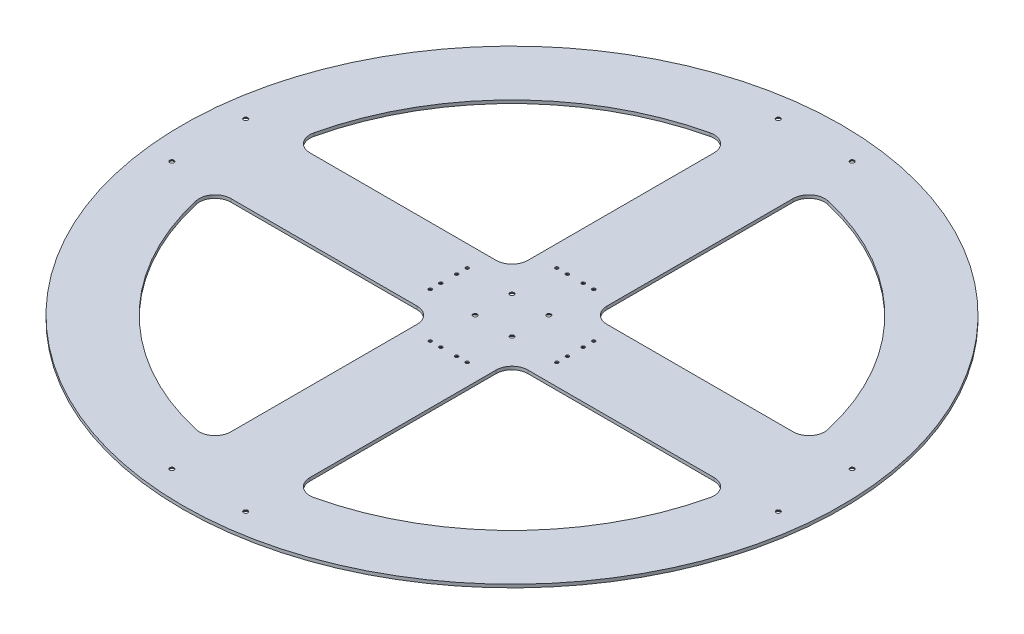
from build123d import *

# Parameters (mm, degrees)
ESQUISSE1_R                               = 625
BOSS_EXTRU_1_DEPTH                        = 6
CONG_1_R                                  = 30
ESQUISSE2_R                               = 4
ENL_V_MAT_EXTRU_1_DEPTH                   = 884.903840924
CHANFREIN1_SIZE                           = 5
ESQUISSE3_R                               = 4.1
ENL_V_MAT_EXTRU_2_DEPTH                   = 884.903840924
CHANFREIN2_SIZE                           = 5
R_P_TITION_CIRCULAIRE1_COUNT              = 4
CHANFREIN2_OF_R_P_TITION_CIRCULAIRE1_SIZE = 5
ESQUISSE4_R                               = 3.05
ENL_V_MAT_EXTRU_3_DEPTH                   = 884.903840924
CHANFREIN3_SIZE                           = 4
R_P_TITION_CIRCULAIRE2_COUNT              = 4
CHANFREIN3_OF_R_P_TITION_CIRCULAIRE2_SIZE = 4


with BuildPart() as part:
    # Esquisse1 → Boss.-Extru.1 (new body)
    with BuildSketch(Plane(origin=(0, 0, 0), x_dir=(1, 0, 0), z_dir=(0, 1, 0))):
        with Locations(Location((0, 0, 0), (0, 0, 270))):
            Circle(ESQUISSE1_R)
        with BuildLine():
            Line((-75, 494.342998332), (-75, 75))
            Line((-75, 75), (-494.342998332, 75))
            ThreePointArc((-494.342998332, 75), (-353.553390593, 353.553390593), (-75, 494.342998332))
        make_face(mode=Mode.SUBTRACT)
        with BuildLine():
            Line((494.342998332, 75), (75, 75))
            Line((75, 75), (75, 494.342998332))
            ThreePointArc((75, 494.342998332), (353.553390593, 353.553390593), (494.342998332, 75))
        make_face(mode=Mode.SUBTRACT)
        with BuildLine():
            Line((494.342998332, -75), (75, -75))
            Line((75, -75), (75, -494.342998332))
            ThreePointArc((75, -494.342998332), (353.553390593, -353.553390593), (494.342998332, -75))
        make_face(mode=Mode.SUBTRACT)
        with BuildLine():
            Line((-75, -75), (-75, -494.342998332))
            ThreePointArc((-75, -494.342998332), (-353.553390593, -353.553390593), (-494.342998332, -75))
            Line((-494.342998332, -75), (-75, -75))
        make_face(mode=Mode.SUBTRACT)
    extrude(amount=BOSS_EXTRU_1_DEPTH)

    # Cong_1
    cong_1_edges = [part.edges().sort_by_distance(p)[0] for p in [
        (-494.342998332, 3, -75),
        (-75, 3, -75),
        (-75, 3, -494.342998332),
        (75, 3, 75),
        (75, 3, 494.342998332),
        (494.342998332, 3, 75),
        (75, 3, -494.342998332),
        (75, 3, -75),
        (494.342998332, 3, -75),
        (-494.342998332, 3, 75),
        (-75, 3, 494.342998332),
        (-75, 3, 75),
    ]]
    fillet(cong_1_edges, radius=CONG_1_R)

    # Esquisse2 → Enl_v. mat.-Extru.1 (cut, through all)
    with BuildSketch(Plane(origin=(0, 6, 0), x_dir=(1, 0, 0), z_dir=(0, 1, 0))):
        with Locations(Location((-35, 35, 0), (0, 0, 270))):
            Circle(ESQUISSE2_R)
        with Locations(Location((-35, -35, 0), (0, 0, 270))):
            Circle(ESQUISSE2_R)
        with Locations(Location((35, -35, 0), (0, 0, 270))):
            Circle(ESQUISSE2_R)
        with Locations(Location((35, 35, 0), (0, 0, 270))):
            Circle(ESQUISSE2_R)
    extrude(amount=-ENL_V_MAT_EXTRU_1_DEPTH, mode=Mode.SUBTRACT)

    # Chanfrein1
    chanfrein1_edges = [part.edges().sort_by_distance(p)[0] for p in [
        (-35, 0, -39),
        (-35, 0, 31),
        (35, 0, 31),
        (35, 0, -39),
    ]]
    chamfer(chanfrein1_edges, length=CHANFREIN1_SIZE)

    # Esquisse3 → Enl_v. mat.-Extru.2 (cut, through all)
    with BuildSketch(Plane(origin=(0, 6, 0), x_dir=(1, 0, 0), z_dir=(0, 1, 0))):
        with Locations(Location((-70, 575, 0), (0, 0, 270))):
            Circle(ESQUISSE3_R)
        with Locations(Location((70, 575, 0), (0, 0, 270))):
            Circle(ESQUISSE3_R)
    enl_v_mat_extru_2 = extrude(amount=-ENL_V_MAT_EXTRU_2_DEPTH, mode=Mode.SUBTRACT)

    # Chanfrein2
    chanfrein2_edges = [part.edges().sort_by_distance(p)[0] for p in [
        (70, 0, -579.1),
        (-70, 0, -579.1),
    ]]
    chamfer(chanfrein2_edges, length=CHANFREIN2_SIZE)

    # R_p_tition circulaire1: Enl_v. mat.-Extru.2 ×4 about axis
    r_p_tition_circulaire1_axis = Axis((0, 0, 0), (0, 1, 0))
    for i in range(1, R_P_TITION_CIRCULAIRE1_COUNT):
        add(enl_v_mat_extru_2.rotate(r_p_tition_circulaire1_axis, i * 360 / R_P_TITION_CIRCULAIRE1_COUNT), mode=Mode.SUBTRACT)

    # Chanfrein2 of R_p_tition circulaire1
    chanfrein2_of_r_p_tition_circulaire1_edges = [part.edges().sort_by_distance(p)[0] for p in [
        (-579.1, 0, -70),
        (-579.1, 0, 70),
        (-70, 0, 579.1),
        (70, 0, 579.1),
        (579.1, 0, 70),
        (579.1, 0, -70),
    ]]
    chamfer(chanfrein2_of_r_p_tition_circulaire1_edges, length=CHANFREIN2_OF_R_P_TITION_CIRCULAIRE1_SIZE)

    # Esquisse4 → Enl_v. mat.-Extru.3 (cut, through all)
    with BuildSketch(Plane(origin=(0, 6, 0), x_dir=(1, 0, 0), z_dir=(0, 1, 0))):
        with Locations(Location((120, 35, 0), (0, 0, 270))):
            Circle(ESQUISSE4_R)
        with Locations(Location((120, 15, 0), (0, 0, 270))):
            Circle(ESQUISSE4_R)
        with Locations(Location((120, -15, 0), (0, 0, 270))):
            Circle(ESQUISSE4_R)
        with Locations(Location((120, -35, 0), (0, 0, 270))):
            Circle(ESQUISSE4_R)
    enl_v_mat_extru_3 = extrude(amount=-ENL_V_MAT_EXTRU_3_DEPTH, mode=Mode.SUBTRACT)

    # Chanfrein3
    chanfrein3_edges = [part.edges().sort_by_distance(p)[0] for p in [
        (120, 0, -38.05),
        (120, 0, -18.05),
        (120, 0, 11.95),
        (120, 0, 31.95),
    ]]
    chamfer(chanfrein3_edges, length=CHANFREIN3_SIZE)

    # R_p_tition circulaire2: Enl_v. mat.-Extru.3 ×4 about axis
    r_p_tition_circulaire2_axis = Axis((0, 0, 0), (0, 1, 0))
    for i in range(1, R_P_TITION_CIRCULAIRE2_COUNT):
        add(enl_v_mat_extru_3.rotate(r_p_tition_circulaire2_axis, i * 360 / R_P_TITION_CIRCULAIRE2_COUNT), mode=Mode.SUBTRACT)

    # Chanfrein3 of R_p_tition circulaire2
    chanfrein3_of_r_p_tition_circulaire2_edges = [part.edges().sort_by_distance(p)[0] for p in [
        (-38.05, 0, -120),
        (-18.05, 0, -120),
        (11.95, 0, -120),
        (31.95, 0, -120),
        (-120, 0, 38.05),
        (-120, 0, 18.05),
        (-120, 0, -11.95),
        (-120, 0, -31.95),
        (38.05, 0, 120),
        (18.05, 0, 120),
        (-11.95, 0, 120),
        (-31.95, 0, 120),
    ]]
    chamfer(chanfrein3_of_r_p_tition_circulaire2_edges, length=CHANFREIN3_OF_R_P_TITION_CIRCULAIRE2_SIZE)


solid = part.part
